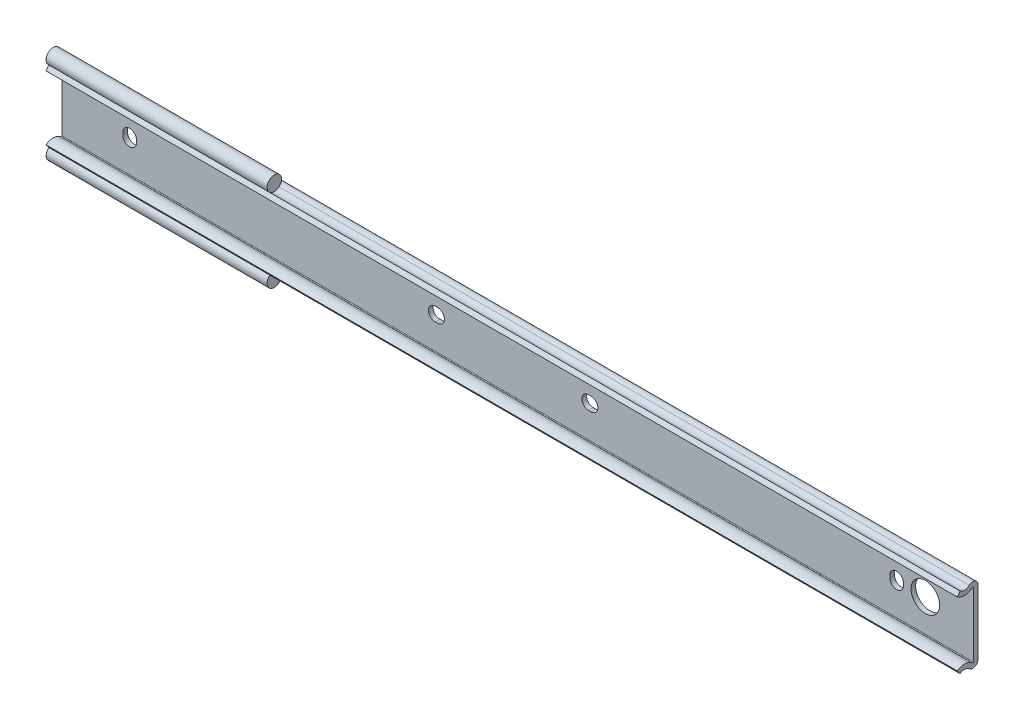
ISO-10303-21;
HEADER;
FILE_DESCRIPTION(('STEP AP214'),'2;1');
FILE_NAME('part.step','',(''),(''),'','','');
FILE_SCHEMA(('AUTOMOTIVE_DESIGN { 1 0 10303 214 1 1 1 1 }'));
ENDSEC;
DATA;
#1=APPLICATION_CONTEXT('core data for automotive mechanical design processes');
#2=APPLICATION_PROTOCOL_DEFINITION('international standard','automotive_design',2000,#1);
#3=PRODUCT_CONTEXT('',#1,'mechanical');
#4=PRODUCT('Part','Part','',(#3));
#5=PRODUCT_RELATED_PRODUCT_CATEGORY('part','',(#4));
#6=PRODUCT_DEFINITION_FORMATION('','',#4);
#7=PRODUCT_DEFINITION_CONTEXT('part definition',#1,'design');
#8=PRODUCT_DEFINITION('design','',#6,#7);
#9=PRODUCT_DEFINITION_SHAPE('','',#8);
#10=(LENGTH_UNIT() NAMED_UNIT(*) SI_UNIT(.MILLI.,.METRE.));
#11=(NAMED_UNIT(*) PLANE_ANGLE_UNIT() SI_UNIT($,.RADIAN.));
#12=(NAMED_UNIT(*) SI_UNIT($,.STERADIAN.) SOLID_ANGLE_UNIT());
#13=UNCERTAINTY_MEASURE_WITH_UNIT(LENGTH_MEASURE(1.E-05),#10,'distance_accuracy_value','');
#14=(GEOMETRIC_REPRESENTATION_CONTEXT(3) GLOBAL_UNCERTAINTY_ASSIGNED_CONTEXT((#13)) GLOBAL_UNIT_ASSIGNED_CONTEXT((#10,
#11,#12)) REPRESENTATION_CONTEXT('',''));
#15=CARTESIAN_POINT('',(0.,0.,0.));
#16=DIRECTION('',(0.,0.,1.));
#17=DIRECTION('',(1.,0.,0.));
#18=AXIS2_PLACEMENT_3D('',#15,#16,#17);
#19=CARTESIAN_POINT('',(279.4,10.6847650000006,1.74000019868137));
#20=DIRECTION('',(-1.,0.,0.));
#21=DIRECTION('',(0.,0.,1.));
#22=AXIS2_PLACEMENT_3D('',#19,#20,#21);
#23=CYLINDRICAL_SURFACE('',#22,1.7400001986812);
#24=CARTESIAN_POINT('',(-22.4,10.6847650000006,1.74000019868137));
#25=DIRECTION('',(1.,0.,0.));
#26=DIRECTION('',(0.,0.,-1.));
#27=AXIS2_PLACEMENT_3D('',#24,#25,#26);
#28=CIRCLE('',#27,1.7400001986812);
#29=CARTESIAN_POINT('',(-22.4,12.421670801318,1.84372545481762));
#30=VERTEX_POINT('',#29);
#31=CARTESIAN_POINT('',(-22.4,12.1726708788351,2.64207380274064));
#32=VERTEX_POINT('',#31);
#33=EDGE_CURVE('E251',#30,#32,#28,.T.);
#34=ORIENTED_EDGE('',*,*,#33,.T.);
#35=DIRECTION('',(-1.,0.,0.));
#36=VECTOR('',#35,1.);
#37=CARTESIAN_POINT('',(14.2,12.1726708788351,2.64207380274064));
#38=LINE('',#37,#36);
#39=CARTESIAN_POINT('',(50.8,12.1726708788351,2.64207380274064));
#40=VERTEX_POINT('',#39);
#41=EDGE_CURVE('E468',#32,#40,#38,.F.);
#42=ORIENTED_EDGE('',*,*,#41,.T.);
#43=CARTESIAN_POINT('',(50.8,10.6847650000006,1.74000019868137));
#44=DIRECTION('',(-1.,0.,0.));
#45=DIRECTION('',(0.,0.,1.));
#46=AXIS2_PLACEMENT_3D('',#43,#44,#45);
#47=CIRCLE('',#46,1.7400001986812);
#48=CARTESIAN_POINT('',(50.8,11.9768810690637,2.90534853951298));
#49=VERTEX_POINT('',#48);
#50=EDGE_CURVE('E464',#49,#40,#47,.T.);
#51=ORIENTED_EDGE('',*,*,#50,.F.);
#52=DIRECTION('',(-1.,0.,0.));
#53=VECTOR('',#52,1.);
#54=CARTESIAN_POINT('',(279.4,11.9768810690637,2.90534853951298));
#55=LINE('',#54,#53);
#56=CARTESIAN_POINT('',(279.4,11.9768810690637,2.90534853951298));
#57=VERTEX_POINT('',#56);
#58=EDGE_CURVE('E341',#57,#49,#55,.T.);
#59=ORIENTED_EDGE('',*,*,#58,.F.);
#60=CARTESIAN_POINT('',(279.4,10.6847650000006,1.74000019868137));
#61=DIRECTION('',(1.,0.,0.));
#62=DIRECTION('',(0.,0.,-1.));
#63=AXIS2_PLACEMENT_3D('',#60,#61,#62);
#64=CIRCLE('',#63,1.7400001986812);
#65=CARTESIAN_POINT('',(279.4,12.421670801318,1.84372545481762));
#66=VERTEX_POINT('',#65);
#67=EDGE_CURVE('E248',#66,#57,#64,.T.);
#68=ORIENTED_EDGE('',*,*,#67,.F.);
#69=CARTESIAN_POINT('',(279.4,10.6847650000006,1.74000019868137));
#70=DIRECTION('',(-1.,0.,0.));
#71=DIRECTION('',(0.,0.998221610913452,0.0596122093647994));
#72=AXIS2_PLACEMENT_3D('',#69,#70,#71);
#73=CIRCLE('',#72,1.7400001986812);
#74=CARTESIAN_POINT('',(279.4,12.421670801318,1.63627494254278));
#75=VERTEX_POINT('',#74);
#76=EDGE_CURVE('E239',#66,#75,#73,.T.);
#77=ORIENTED_EDGE('',*,*,#76,.T.);
#78=CARTESIAN_POINT('',(279.4,10.6847650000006,0.));
#79=VERTEX_POINT('',#78);
#80=EDGE_CURVE('E236',#79,#75,#64,.T.);
#81=ORIENTED_EDGE('',*,*,#80,.F.);
#82=DIRECTION('',(-1.,0.,0.));
#83=VECTOR('',#82,1.);
#84=CARTESIAN_POINT('',(279.4,10.6847650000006,0.));
#85=LINE('',#84,#83);
#86=CARTESIAN_POINT('',(-22.4,10.6847650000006,0.));
#87=VERTEX_POINT('',#86);
#88=EDGE_CURVE('E373',#79,#87,#85,.T.);
#89=ORIENTED_EDGE('',*,*,#88,.T.);
#90=CARTESIAN_POINT('',(-22.4,12.421670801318,1.63627494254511));
#91=VERTEX_POINT('',#90);
#92=EDGE_CURVE('E268',#87,#91,#28,.T.);
#93=ORIENTED_EDGE('',*,*,#92,.T.);
#94=CARTESIAN_POINT('',(-22.4,10.6847650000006,1.74000019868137));
#95=DIRECTION('',(1.,0.,0.));
#96=DIRECTION('',(0.,0.998221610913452,-0.059612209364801));
#97=AXIS2_PLACEMENT_3D('',#94,#95,#96);
#98=CIRCLE('',#97,1.7400001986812);
#99=EDGE_CURVE('E265',#91,#30,#98,.T.);
#100=ORIENTED_EDGE('',*,*,#99,.T.);
#101=EDGE_LOOP('',(#34,#42,#51,#59,#68,#77,#81,#89,#93,#100));
#102=FACE_BOUND('',#101,.T.);
#103=ADVANCED_FACE('F14',(#102),#23,.T.);
#104=CARTESIAN_POINT('',(279.4,10.6847650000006,1.74000019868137));
#105=DIRECTION('',(1.,0.,0.));
#106=DIRECTION('',(0.,0.,-1.));
#107=AXIS2_PLACEMENT_3D('',#104,#105,#106);
#108=PLANE('',#107);
#109=DIRECTION('',(0.,1.,0.));
#110=VECTOR('',#109,1.);
#111=CARTESIAN_POINT('',(279.4,-10.6847650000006,0.));
#112=LINE('',#111,#110);
#113=CARTESIAN_POINT('',(279.4,-10.6847650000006,0.));
#114=VERTEX_POINT('',#113);
#115=EDGE_CURVE('E243',#114,#79,#112,.T.);
#116=ORIENTED_EDGE('',*,*,#115,.T.);
#117=ORIENTED_EDGE('',*,*,#80,.T.);
#118=ORIENTED_EDGE('',*,*,#76,.F.);
#119=ORIENTED_EDGE('',*,*,#67,.T.);
#120=CARTESIAN_POINT('',(279.4,13.7450000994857,4.50000028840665));
#121=DIRECTION('',(-1.,0.,0.));
#122=DIRECTION('',(0.,0.,-1.));
#123=AXIS2_PLACEMENT_3D('',#120,#121,#122);
#124=CIRCLE('',#123,2.38099960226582);
#125=CARTESIAN_POINT('',(279.4,11.8434490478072,5.93292132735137));
#126=VERTEX_POINT('',#125);
#127=EDGE_CURVE('E247',#57,#126,#124,.T.);
#128=ORIENTED_EDGE('',*,*,#127,.T.);
#129=DIRECTION('',(0.,-0.798635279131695,0.601815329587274));
#130=VECTOR('',#129,1.);
#131=CARTESIAN_POINT('',(279.4,10.6055642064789,6.86573520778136));
#132=LINE('',#131,#130);
#133=CARTESIAN_POINT('',(279.4,10.6055642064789,6.86573520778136));
#134=VERTEX_POINT('',#133);
#135=EDGE_CURVE('E391',#126,#134,#132,.T.);
#136=ORIENTED_EDGE('',*,*,#135,.T.);
#137=CARTESIAN_POINT('',(279.4,13.7450000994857,4.50000028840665));
#138=DIRECTION('',(1.,0.,0.));
#139=DIRECTION('',(0.,0.,-1.));
#140=AXIS2_PLACEMENT_3D('',#137,#138,#139);
#141=CIRCLE('',#140,3.9309998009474);
#142=CARTESIAN_POINT('',(279.4,10.8258581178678,1.86725086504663));
#143=VERTEX_POINT('',#142);
#144=EDGE_CURVE('E390',#134,#143,#141,.T.);
#145=ORIENTED_EDGE('',*,*,#144,.T.);
#146=CARTESIAN_POINT('',(279.4,10.6847650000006,1.74000019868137));
#147=DIRECTION('',(-1.,0.,0.));
#148=DIRECTION('',(0.,0.,-1.));
#149=AXIS2_PLACEMENT_3D('',#146,#147,#148);
#150=CIRCLE('',#149,0.18999999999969);
#151=CARTESIAN_POINT('',(279.4,10.6847650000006,1.55000019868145));
#152=VERTEX_POINT('',#151);
#153=EDGE_CURVE('E388',#143,#152,#150,.T.);
#154=ORIENTED_EDGE('',*,*,#153,.T.);
#155=DIRECTION('',(0.,-1.,0.));
#156=VECTOR('',#155,1.);
#157=CARTESIAN_POINT('',(279.4,-10.6847650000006,1.55000019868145));
#158=LINE('',#157,#156);
#159=CARTESIAN_POINT('',(279.4,-10.6847650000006,1.55000019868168));
#160=VERTEX_POINT('',#159);
#161=EDGE_CURVE('E386',#152,#160,#158,.T.);
#162=ORIENTED_EDGE('',*,*,#161,.T.);
#163=CARTESIAN_POINT('',(279.4,-10.6847650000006,1.74000019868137));
#164=DIRECTION('',(-1.,0.,0.));
#165=DIRECTION('',(0.,0.,1.));
#166=AXIS2_PLACEMENT_3D('',#163,#164,#165);
#167=CIRCLE('',#166,0.18999999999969);
#168=CARTESIAN_POINT('',(279.4,-10.8258581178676,1.86725086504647));
#169=VERTEX_POINT('',#168);
#170=EDGE_CURVE('E384',#160,#169,#167,.T.);
#171=ORIENTED_EDGE('',*,*,#170,.T.);
#172=CARTESIAN_POINT('',(279.4,-13.7450000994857,4.50000028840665));
#173=DIRECTION('',(1.,0.,0.));
#174=DIRECTION('',(0.,0.,1.));
#175=AXIS2_PLACEMENT_3D('',#172,#173,#174);
#176=CIRCLE('',#175,3.9309998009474);
#177=CARTESIAN_POINT('',(279.4,-10.6055642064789,6.86573520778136));
#178=VERTEX_POINT('',#177);
#179=EDGE_CURVE('E382',#169,#178,#176,.T.);
#180=ORIENTED_EDGE('',*,*,#179,.T.);
#181=DIRECTION('',(0.,-0.798635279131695,-0.601815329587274));
#182=VECTOR('',#181,1.);
#183=CARTESIAN_POINT('',(279.4,-10.6055642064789,6.86573520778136));
#184=LINE('',#183,#182);
#185=CARTESIAN_POINT('',(279.4,-11.8434490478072,5.93292132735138));
#186=VERTEX_POINT('',#185);
#187=EDGE_CURVE('E380',#178,#186,#184,.T.);
#188=ORIENTED_EDGE('',*,*,#187,.T.);
#189=CARTESIAN_POINT('',(279.4,-13.7450000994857,4.50000028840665));
#190=DIRECTION('',(-1.,0.,0.));
#191=DIRECTION('',(0.,0.,1.));
#192=AXIS2_PLACEMENT_3D('',#189,#190,#191);
#193=CIRCLE('',#192,2.38099960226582);
#194=CARTESIAN_POINT('',(279.4,-11.9768810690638,2.90534853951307));
#195=VERTEX_POINT('',#194);
#196=EDGE_CURVE('E378',#186,#195,#193,.T.);
#197=ORIENTED_EDGE('',*,*,#196,.T.);
#198=CARTESIAN_POINT('',(279.4,-10.6847650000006,1.74000019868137));
#199=DIRECTION('',(1.,0.,0.));
#200=DIRECTION('',(0.,0.,1.));
#201=AXIS2_PLACEMENT_3D('',#198,#199,#200);
#202=CIRCLE('',#201,1.7400001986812);
#203=EDGE_CURVE('E376',#195,#114,#202,.T.);
#204=ORIENTED_EDGE('',*,*,#203,.T.);
#205=EDGE_LOOP('',(#116,#117,#118,#119,#128,#136,#145,#154,#162,#171,#180,#188,#197,#204));
#206=FACE_BOUND('',#205,.T.);
#207=ADVANCED_FACE('F238',(#206),#108,.T.);
#208=CARTESIAN_POINT('',(-22.4,10.6847650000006,1.74000019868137));
#209=DIRECTION('',(1.,0.,0.));
#210=DIRECTION('',(0.,0.,-1.));
#211=AXIS2_PLACEMENT_3D('',#208,#209,#210);
#212=PLANE('',#211);
#213=CARTESIAN_POINT('',(-22.4,13.745,4.45));
#214=DIRECTION('',(-1.,0.,0.));
#215=DIRECTION('',(0.,0.,1.));
#216=AXIS2_PLACEMENT_3D('',#213,#214,#215);
#217=CIRCLE('',#216,2.396);
#218=CARTESIAN_POINT('',(-22.3999999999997,11.4666473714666,5.19156948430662));
#219=VERTEX_POINT('',#218);
#220=EDGE_CURVE('E460',#219,#32,#217,.T.);
#221=ORIENTED_EDGE('',*,*,#220,.T.);
#222=ORIENTED_EDGE('',*,*,#33,.F.);
#223=ORIENTED_EDGE('',*,*,#99,.F.);
#224=ORIENTED_EDGE('',*,*,#92,.F.);
#225=DIRECTION('',(0.,1.,0.));
#226=VECTOR('',#225,1.);
#227=CARTESIAN_POINT('',(-22.4,-10.6847650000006,0.));
#228=LINE('',#227,#226);
#229=CARTESIAN_POINT('',(-22.4,-10.6847650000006,0.));
#230=VERTEX_POINT('',#229);
#231=EDGE_CURVE('E294',#230,#87,#228,.T.);
#232=ORIENTED_EDGE('',*,*,#231,.F.);
#233=CARTESIAN_POINT('',(-22.4,-10.6847650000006,1.74000019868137));
#234=DIRECTION('',(1.,0.,0.));
#235=DIRECTION('',(0.,0.,1.));
#236=AXIS2_PLACEMENT_3D('',#233,#234,#235);
#237=CIRCLE('',#236,1.7400001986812);
#238=CARTESIAN_POINT('',(-22.4,-12.1726708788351,2.64207380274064));
#239=VERTEX_POINT('',#238);
#240=EDGE_CURVE('E292',#239,#230,#237,.T.);
#241=ORIENTED_EDGE('',*,*,#240,.F.);
#242=CARTESIAN_POINT('',(-22.4,-13.745,4.45));
#243=DIRECTION('',(-1.,0.,0.));
#244=DIRECTION('',(0.,0.,-1.));
#245=AXIS2_PLACEMENT_3D('',#242,#243,#244);
#246=CIRCLE('',#245,2.396);
#247=CARTESIAN_POINT('',(-22.4,-11.4666473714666,5.19156948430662));
#248=VERTEX_POINT('',#247);
#249=EDGE_CURVE('E442',#239,#248,#246,.T.);
#250=ORIENTED_EDGE('',*,*,#249,.T.);
#251=CARTESIAN_POINT('',(-22.4,-13.7450000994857,4.50000028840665));
#252=DIRECTION('',(-1.,0.,0.));
#253=DIRECTION('',(0.,0.,1.));
#254=AXIS2_PLACEMENT_3D('',#251,#252,#253);
#255=CIRCLE('',#254,2.38099960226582);
#256=CARTESIAN_POINT('',(-22.4,-11.8434490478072,5.93292132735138));
#257=VERTEX_POINT('',#256);
#258=EDGE_CURVE('E37',#257,#248,#255,.T.);
#259=ORIENTED_EDGE('',*,*,#258,.F.);
#260=DIRECTION('',(0.,-0.798635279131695,-0.601815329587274));
#261=VECTOR('',#260,1.);
#262=CARTESIAN_POINT('',(-22.4,-10.6055642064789,6.86573520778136));
#263=LINE('',#262,#261);
#264=CARTESIAN_POINT('',(-22.4,-10.6055642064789,6.86573520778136));
#265=VERTEX_POINT('',#264);
#266=EDGE_CURVE('E289',#265,#257,#263,.T.);
#267=ORIENTED_EDGE('',*,*,#266,.F.);
#268=CARTESIAN_POINT('',(-22.4,-13.7450000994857,4.50000028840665));
#269=DIRECTION('',(1.,0.,0.));
#270=DIRECTION('',(0.,0.,1.));
#271=AXIS2_PLACEMENT_3D('',#268,#269,#270);
#272=CIRCLE('',#271,3.9309998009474);
#273=CARTESIAN_POINT('',(-22.4,-10.8258581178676,1.86725086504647));
#274=VERTEX_POINT('',#273);
#275=EDGE_CURVE('E287',#274,#265,#272,.T.);
#276=ORIENTED_EDGE('',*,*,#275,.F.);
#277=CARTESIAN_POINT('',(-22.4,-10.6847650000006,1.74000019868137));
#278=DIRECTION('',(-1.,0.,0.));
#279=DIRECTION('',(0.,0.,1.));
#280=AXIS2_PLACEMENT_3D('',#277,#278,#279);
#281=CIRCLE('',#280,0.18999999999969);
#282=CARTESIAN_POINT('',(-22.4,-10.6847650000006,1.55000019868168));
#283=VERTEX_POINT('',#282);
#284=EDGE_CURVE('E285',#283,#274,#281,.T.);
#285=ORIENTED_EDGE('',*,*,#284,.F.);
#286=DIRECTION('',(0.,-1.,0.));
#287=VECTOR('',#286,1.);
#288=CARTESIAN_POINT('',(-22.4,-10.6847650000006,1.55000019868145));
#289=LINE('',#288,#287);
#290=CARTESIAN_POINT('',(-22.4,10.6847650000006,1.55000019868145));
#291=VERTEX_POINT('',#290);
#292=EDGE_CURVE('E283',#291,#283,#289,.T.);
#293=ORIENTED_EDGE('',*,*,#292,.F.);
#294=CARTESIAN_POINT('',(-22.4,10.6847650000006,1.74000019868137));
#295=DIRECTION('',(-1.,0.,0.));
#296=DIRECTION('',(0.,0.,-1.));
#297=AXIS2_PLACEMENT_3D('',#294,#295,#296);
#298=CIRCLE('',#297,0.18999999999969);
#299=CARTESIAN_POINT('',(-22.4,10.8258581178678,1.86725086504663));
#300=VERTEX_POINT('',#299);
#301=EDGE_CURVE('E281',#300,#291,#298,.T.);
#302=ORIENTED_EDGE('',*,*,#301,.F.);
#303=CARTESIAN_POINT('',(-22.4,13.7450000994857,4.50000028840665));
#304=DIRECTION('',(1.,0.,0.));
#305=DIRECTION('',(0.,0.,-1.));
#306=AXIS2_PLACEMENT_3D('',#303,#304,#305);
#307=CIRCLE('',#306,3.9309998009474);
#308=CARTESIAN_POINT('',(-22.4,10.6055642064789,6.86573520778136));
#309=VERTEX_POINT('',#308);
#310=EDGE_CURVE('E279',#309,#300,#307,.T.);
#311=ORIENTED_EDGE('',*,*,#310,.F.);
#312=DIRECTION('',(0.,-0.798635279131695,0.601815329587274));
#313=VECTOR('',#312,1.);
#314=CARTESIAN_POINT('',(-22.4,10.6055642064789,6.86573520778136));
#315=LINE('',#314,#313);
#316=CARTESIAN_POINT('',(-22.4,11.8434490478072,5.93292132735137));
#317=VERTEX_POINT('',#316);
#318=EDGE_CURVE('E277',#317,#309,#315,.T.);
#319=ORIENTED_EDGE('',*,*,#318,.F.);
#320=CARTESIAN_POINT('',(-22.4,13.7450000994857,4.50000028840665));
#321=DIRECTION('',(-1.,0.,0.));
#322=DIRECTION('',(0.,0.,-1.));
#323=AXIS2_PLACEMENT_3D('',#320,#321,#322);
#324=CIRCLE('',#323,2.38099960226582);
#325=EDGE_CURVE('E274',#219,#317,#324,.T.);
#326=ORIENTED_EDGE('',*,*,#325,.F.);
#327=EDGE_LOOP('',(#221,#222,#223,#224,#232,#241,#250,#259,#267,#276,#285,#293,#302,#311,#319,#326));
#328=FACE_BOUND('',#327,.T.);
#329=ADVANCED_FACE('F308',(#328),#212,.F.);
#330=CARTESIAN_POINT('',(279.4,13.7450000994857,4.50000028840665));
#331=DIRECTION('',(-1.,0.,0.));
#332=DIRECTION('',(0.,0.,1.));
#333=AXIS2_PLACEMENT_3D('',#330,#331,#332);
#334=CYLINDRICAL_SURFACE('',#333,2.38099960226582);
#335=CARTESIAN_POINT('',(50.8,13.7450000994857,4.50000028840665));
#336=DIRECTION('',(-1.,0.,0.));
#337=DIRECTION('',(0.,0.,1.));
#338=AXIS2_PLACEMENT_3D('',#335,#336,#337);
#339=CIRCLE('',#338,2.38099960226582);
#340=CARTESIAN_POINT('',(50.8,11.4666473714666,5.19156948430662));
#341=VERTEX_POINT('',#340);
#342=EDGE_CURVE('E338',#341,#49,#339,.F.);
#343=ORIENTED_EDGE('',*,*,#342,.F.);
#344=DIRECTION('',(-1.,0.,0.));
#345=VECTOR('',#344,1.);
#346=CARTESIAN_POINT('',(14.2,11.4666473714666,5.19156948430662));
#347=LINE('',#346,#345);
#348=EDGE_CURVE('E335',#341,#219,#347,.T.);
#349=ORIENTED_EDGE('',*,*,#348,.T.);
#350=ORIENTED_EDGE('',*,*,#325,.T.);
#351=DIRECTION('',(-1.,0.,0.));
#352=VECTOR('',#351,1.);
#353=CARTESIAN_POINT('',(279.4,11.8434490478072,5.93292132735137));
#354=LINE('',#353,#352);
#355=EDGE_CURVE('E344',#126,#317,#354,.T.);
#356=ORIENTED_EDGE('',*,*,#355,.F.);
#357=ORIENTED_EDGE('',*,*,#127,.F.);
#358=ORIENTED_EDGE('',*,*,#58,.T.);
#359=EDGE_LOOP('',(#343,#349,#350,#356,#357,#358));
#360=FACE_BOUND('',#359,.T.);
#361=ADVANCED_FACE('F318',(#360),#334,.F.);
#362=CARTESIAN_POINT('',(279.4,10.6055642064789,6.86573520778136));
#363=DIRECTION('',(0.,-0.601815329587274,-0.798635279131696));
#364=DIRECTION('',(0.,0.798635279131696,-0.601815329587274));
#365=AXIS2_PLACEMENT_3D('',#362,#363,#364);
#366=PLANE('',#365);
#367=ORIENTED_EDGE('',*,*,#318,.T.);
#368=DIRECTION('',(-1.,0.,0.));
#369=VECTOR('',#368,1.);
#370=CARTESIAN_POINT('',(279.4,10.6055642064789,6.86573520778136));
#371=LINE('',#370,#369);
#372=EDGE_CURVE('E347',#134,#309,#371,.T.);
#373=ORIENTED_EDGE('',*,*,#372,.F.);
#374=ORIENTED_EDGE('',*,*,#135,.F.);
#375=ORIENTED_EDGE('',*,*,#355,.T.);
#376=EDGE_LOOP('',(#367,#373,#374,#375));
#377=FACE_BOUND('',#376,.T.);
#378=ADVANCED_FACE('F399',(#377),#366,.F.);
#379=CARTESIAN_POINT('',(279.4,13.7450000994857,4.50000028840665));
#380=DIRECTION('',(-1.,0.,0.));
#381=DIRECTION('',(0.,0.,1.));
#382=AXIS2_PLACEMENT_3D('',#379,#380,#381);
#383=CYLINDRICAL_SURFACE('',#382,3.9309998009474);
#384=ORIENTED_EDGE('',*,*,#310,.T.);
#385=DIRECTION('',(-1.,0.,0.));
#386=VECTOR('',#385,1.);
#387=CARTESIAN_POINT('',(279.4,10.8258581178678,1.86725086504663));
#388=LINE('',#387,#386);
#389=EDGE_CURVE('E350',#143,#300,#388,.T.);
#390=ORIENTED_EDGE('',*,*,#389,.F.);
#391=ORIENTED_EDGE('',*,*,#144,.F.);
#392=ORIENTED_EDGE('',*,*,#372,.T.);
#393=EDGE_LOOP('',(#384,#390,#391,#392));
#394=FACE_BOUND('',#393,.T.);
#395=ADVANCED_FACE('F404',(#394),#383,.T.);
#396=CARTESIAN_POINT('',(279.4,10.6847650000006,1.74000019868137));
#397=DIRECTION('',(-1.,0.,0.));
#398=DIRECTION('',(0.,0.,1.));
#399=AXIS2_PLACEMENT_3D('',#396,#397,#398);
#400=CYLINDRICAL_SURFACE('',#399,0.18999999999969);
#401=ORIENTED_EDGE('',*,*,#301,.T.);
#402=DIRECTION('',(-1.,0.,0.));
#403=VECTOR('',#402,1.);
#404=CARTESIAN_POINT('',(279.4,10.6847650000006,1.55000019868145));
#405=LINE('',#404,#403);
#406=EDGE_CURVE('E353',#152,#291,#405,.T.);
#407=ORIENTED_EDGE('',*,*,#406,.F.);
#408=ORIENTED_EDGE('',*,*,#153,.F.);
#409=ORIENTED_EDGE('',*,*,#389,.T.);
#410=EDGE_LOOP('',(#401,#407,#408,#409));
#411=FACE_BOUND('',#410,.T.);
#412=ADVANCED_FACE('F410',(#411),#400,.F.);
#413=CARTESIAN_POINT('',(279.4,-10.6847650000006,1.55000019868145));
#414=DIRECTION('',(0.,0.,-1.));
#415=DIRECTION('',(-1.,0.,0.));
#416=AXIS2_PLACEMENT_3D('',#413,#414,#415);
#417=PLANE('',#416);
#418=CARTESIAN_POINT('',(263.5,0.,1.55000019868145));
#419=DIRECTION('',(0.,0.,-1.));
#420=DIRECTION('',(-1.,0.,0.));
#421=AXIS2_PLACEMENT_3D('',#418,#419,#420);
#422=CIRCLE('',#421,4.75);
#423=CARTESIAN_POINT('',(258.75,0.,1.55000019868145));
#424=VERTEX_POINT('',#423);
#425=EDGE_CURVE('E450',#424,#424,#422,.F.);
#426=ORIENTED_EDGE('',*,*,#425,.F.);
#427=EDGE_LOOP('',(#426));
#428=FACE_BOUND('',#427,.T.);
#429=DIRECTION('',(0.,-1.,0.));
#430=VECTOR('',#429,1.);
#431=CARTESIAN_POINT('',(-2.25,-0.4,1.55000019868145));
#432=LINE('',#431,#430);
#433=CARTESIAN_POINT('',(-2.25,0.4,1.55000019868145));
#434=VERTEX_POINT('',#433);
#435=CARTESIAN_POINT('',(-2.25,-0.4,1.55000019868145));
#436=VERTEX_POINT('',#435);
#437=EDGE_CURVE('E472',#434,#436,#432,.T.);
#438=ORIENTED_EDGE('',*,*,#437,.F.);
#439=CARTESIAN_POINT('',(0.,0.4,1.55000019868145));
#440=DIRECTION('',(0.,0.,-1.));
#441=DIRECTION('',(-1.,0.,0.));
#442=AXIS2_PLACEMENT_3D('',#439,#440,#441);
#443=CIRCLE('',#442,2.24999999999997);
#444=CARTESIAN_POINT('',(2.25,0.4,1.55000019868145));
#445=VERTEX_POINT('',#444);
#446=EDGE_CURVE('E475',#445,#434,#443,.F.);
#447=ORIENTED_EDGE('',*,*,#446,.F.);
#448=DIRECTION('',(0.,1.,0.));
#449=VECTOR('',#448,1.);
#450=CARTESIAN_POINT('',(2.25,0.4,1.55000019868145));
#451=LINE('',#450,#449);
#452=CARTESIAN_POINT('',(2.25,-0.4,1.55000019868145));
#453=VERTEX_POINT('',#452);
#454=EDGE_CURVE('E492',#453,#445,#451,.T.);
#455=ORIENTED_EDGE('',*,*,#454,.F.);
#456=CARTESIAN_POINT('',(0.,-0.4,1.55000019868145));
#457=DIRECTION('',(0.,0.,-1.));
#458=DIRECTION('',(-1.,0.,0.));
#459=AXIS2_PLACEMENT_3D('',#456,#457,#458);
#460=CIRCLE('',#459,2.24999999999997);
#461=EDGE_CURVE('E470',#436,#453,#460,.F.);
#462=ORIENTED_EDGE('',*,*,#461,.F.);
#463=EDGE_LOOP('',(#438,#447,#455,#462));
#464=FACE_BOUND('',#463,.T.);
#465=DIRECTION('',(-1.,0.,0.));
#466=VECTOR('',#465,1.);
#467=CARTESIAN_POINT('',(152.8,2.25,1.55000019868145));
#468=LINE('',#467,#466);
#469=CARTESIAN_POINT('',(152.8,2.25,1.55000019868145));
#470=VERTEX_POINT('',#469);
#471=CARTESIAN_POINT('',(152.,2.25,1.55000019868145));
#472=VERTEX_POINT('',#471);
#473=EDGE_CURVE('E503',#470,#472,#468,.T.);
#474=ORIENTED_EDGE('',*,*,#473,.F.);
#475=CARTESIAN_POINT('',(152.8,0.,1.55000019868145));
#476=DIRECTION('',(0.,0.,-1.));
#477=DIRECTION('',(-1.,0.,0.));
#478=AXIS2_PLACEMENT_3D('',#475,#476,#477);
#479=CIRCLE('',#478,2.25);
#480=CARTESIAN_POINT('',(152.8,-2.25,1.55000019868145));
#481=VERTEX_POINT('',#480);
#482=EDGE_CURVE('E506',#481,#470,#479,.F.);
#483=ORIENTED_EDGE('',*,*,#482,.F.);
#484=DIRECTION('',(1.,0.,0.));
#485=VECTOR('',#484,1.);
#486=CARTESIAN_POINT('',(152.8,-2.25,1.55000019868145));
#487=LINE('',#486,#485);
#488=CARTESIAN_POINT('',(152.,-2.25,1.55000019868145));
#489=VERTEX_POINT('',#488);
#490=EDGE_CURVE('E523',#489,#481,#487,.T.);
#491=ORIENTED_EDGE('',*,*,#490,.F.);
#492=CARTESIAN_POINT('',(152.,0.,1.55000019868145));
#493=DIRECTION('',(0.,0.,-1.));
#494=DIRECTION('',(-1.,0.,0.));
#495=AXIS2_PLACEMENT_3D('',#492,#493,#494);
#496=CIRCLE('',#495,2.25);
#497=EDGE_CURVE('E501',#472,#489,#496,.F.);
#498=ORIENTED_EDGE('',*,*,#497,.F.);
#499=EDGE_LOOP('',(#474,#483,#491,#498));
#500=FACE_BOUND('',#499,.T.);
#501=DIRECTION('',(-1.,0.,0.));
#502=VECTOR('',#501,1.);
#503=CARTESIAN_POINT('',(102.,2.25,1.55000019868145));
#504=LINE('',#503,#502);
#505=CARTESIAN_POINT('',(102.,2.25,1.55000019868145));
#506=VERTEX_POINT('',#505);
#507=CARTESIAN_POINT('',(101.2,2.25,1.55000019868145));
#508=VERTEX_POINT('',#507);
#509=EDGE_CURVE('E534',#506,#508,#504,.T.);
#510=ORIENTED_EDGE('',*,*,#509,.F.);
#511=CARTESIAN_POINT('',(102.,0.,1.55000019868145));
#512=DIRECTION('',(0.,0.,-1.));
#513=DIRECTION('',(-1.,0.,0.));
#514=AXIS2_PLACEMENT_3D('',#511,#512,#513);
#515=CIRCLE('',#514,2.25);
#516=CARTESIAN_POINT('',(102.,-2.25,1.55000019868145));
#517=VERTEX_POINT('',#516);
#518=EDGE_CURVE('E537',#517,#506,#515,.F.);
#519=ORIENTED_EDGE('',*,*,#518,.F.);
#520=DIRECTION('',(1.,0.,0.));
#521=VECTOR('',#520,1.);
#522=CARTESIAN_POINT('',(102.,-2.25,1.55000019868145));
#523=LINE('',#522,#521);
#524=CARTESIAN_POINT('',(101.2,-2.25,1.55000019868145));
#525=VERTEX_POINT('',#524);
#526=EDGE_CURVE('E554',#525,#517,#523,.T.);
#527=ORIENTED_EDGE('',*,*,#526,.F.);
#528=CARTESIAN_POINT('',(101.2,0.,1.55000019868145));
#529=DIRECTION('',(0.,0.,-1.));
#530=DIRECTION('',(-1.,0.,0.));
#531=AXIS2_PLACEMENT_3D('',#528,#529,#530);
#532=CIRCLE('',#531,2.25);
#533=EDGE_CURVE('E532',#508,#525,#532,.F.);
#534=ORIENTED_EDGE('',*,*,#533,.F.);
#535=EDGE_LOOP('',(#510,#519,#527,#534));
#536=FACE_BOUND('',#535,.T.);
#537=DIRECTION('',(0.,-1.,0.));
#538=VECTOR('',#537,1.);
#539=CARTESIAN_POINT('',(251.75,-0.399999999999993,1.55000019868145));
#540=LINE('',#539,#538);
#541=CARTESIAN_POINT('',(251.75,0.400000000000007,1.55000019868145));
#542=VERTEX_POINT('',#541);
#543=CARTESIAN_POINT('',(251.75,-0.399999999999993,1.55000019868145));
#544=VERTEX_POINT('',#543);
#545=EDGE_CURVE('E565',#542,#544,#540,.T.);
#546=ORIENTED_EDGE('',*,*,#545,.F.);
#547=CARTESIAN_POINT('',(254.,0.400000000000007,1.55000019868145));
#548=DIRECTION('',(0.,0.,-1.));
#549=DIRECTION('',(-1.,0.,0.));
#550=AXIS2_PLACEMENT_3D('',#547,#548,#549);
#551=CIRCLE('',#550,2.24999999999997);
#552=CARTESIAN_POINT('',(256.25,0.400000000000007,1.55000019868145));
#553=VERTEX_POINT('',#552);
#554=EDGE_CURVE('E568',#553,#542,#551,.F.);
#555=ORIENTED_EDGE('',*,*,#554,.F.);
#556=DIRECTION('',(0.,1.,0.));
#557=VECTOR('',#556,1.);
#558=CARTESIAN_POINT('',(256.25,0.400000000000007,1.55000019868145));
#559=LINE('',#558,#557);
#560=CARTESIAN_POINT('',(256.25,-0.399999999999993,1.55000019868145));
#561=VERTEX_POINT('',#560);
#562=EDGE_CURVE('E252',#561,#553,#559,.T.);
#563=ORIENTED_EDGE('',*,*,#562,.F.);
#564=CARTESIAN_POINT('',(254.,-0.399999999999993,1.55000019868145));
#565=DIRECTION('',(0.,0.,-1.));
#566=DIRECTION('',(-1.,0.,0.));
#567=AXIS2_PLACEMENT_3D('',#564,#565,#566);
#568=CIRCLE('',#567,2.24999999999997);
#569=EDGE_CURVE('E563',#544,#561,#568,.F.);
#570=ORIENTED_EDGE('',*,*,#569,.F.);
#571=EDGE_LOOP('',(#546,#555,#563,#570));
#572=FACE_BOUND('',#571,.T.);
#573=ORIENTED_EDGE('',*,*,#292,.T.);
#574=DIRECTION('',(-1.,0.,0.));
#575=VECTOR('',#574,1.);
#576=CARTESIAN_POINT('',(279.4,-10.6847650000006,1.55000019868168));
#577=LINE('',#576,#575);
#578=EDGE_CURVE('E356',#160,#283,#577,.T.);
#579=ORIENTED_EDGE('',*,*,#578,.F.);
#580=ORIENTED_EDGE('',*,*,#161,.F.);
#581=ORIENTED_EDGE('',*,*,#406,.T.);
#582=EDGE_LOOP('',(#573,#579,#580,#581));
#583=FACE_BOUND('',#582,.T.);
#584=ADVANCED_FACE('F414',(#428,#464,#500,#536,#572,#583),#417,.F.);
#585=CARTESIAN_POINT('',(279.4,-10.6847650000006,1.74000019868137));
#586=DIRECTION('',(-1.,0.,0.));
#587=DIRECTION('',(0.,0.,1.));
#588=AXIS2_PLACEMENT_3D('',#585,#586,#587);
#589=CYLINDRICAL_SURFACE('',#588,0.18999999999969);
#590=ORIENTED_EDGE('',*,*,#284,.T.);
#591=DIRECTION('',(-1.,0.,0.));
#592=VECTOR('',#591,1.);
#593=CARTESIAN_POINT('',(279.4,-10.8258581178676,1.86725086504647));
#594=LINE('',#593,#592);
#595=EDGE_CURVE('E359',#169,#274,#594,.T.);
#596=ORIENTED_EDGE('',*,*,#595,.F.);
#597=ORIENTED_EDGE('',*,*,#170,.F.);
#598=ORIENTED_EDGE('',*,*,#578,.T.);
#599=EDGE_LOOP('',(#590,#596,#597,#598));
#600=FACE_BOUND('',#599,.T.);
#601=ADVANCED_FACE('F419',(#600),#589,.F.);
#602=CARTESIAN_POINT('',(279.4,-13.7450000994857,4.50000028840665));
#603=DIRECTION('',(-1.,0.,0.));
#604=DIRECTION('',(0.,0.,1.));
#605=AXIS2_PLACEMENT_3D('',#602,#603,#604);
#606=CYLINDRICAL_SURFACE('',#605,3.9309998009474);
#607=ORIENTED_EDGE('',*,*,#275,.T.);
#608=DIRECTION('',(-1.,0.,0.));
#609=VECTOR('',#608,1.);
#610=CARTESIAN_POINT('',(279.4,-10.6055642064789,6.86573520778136));
#611=LINE('',#610,#609);
#612=EDGE_CURVE('E362',#178,#265,#611,.T.);
#613=ORIENTED_EDGE('',*,*,#612,.F.);
#614=ORIENTED_EDGE('',*,*,#179,.F.);
#615=ORIENTED_EDGE('',*,*,#595,.T.);
#616=EDGE_LOOP('',(#607,#613,#614,#615));
#617=FACE_BOUND('',#616,.T.);
#618=ADVANCED_FACE('F425',(#617),#606,.T.);
#619=CARTESIAN_POINT('',(279.4,-10.6055642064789,6.86573520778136));
#620=DIRECTION('',(0.,0.601815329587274,-0.798635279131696));
#621=DIRECTION('',(0.,0.798635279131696,0.601815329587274));
#622=AXIS2_PLACEMENT_3D('',#619,#620,#621);
#623=PLANE('',#622);
#624=ORIENTED_EDGE('',*,*,#266,.T.);
#625=DIRECTION('',(-1.,0.,0.));
#626=VECTOR('',#625,1.);
#627=CARTESIAN_POINT('',(279.4,-11.8434490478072,5.93292132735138));
#628=LINE('',#627,#626);
#629=EDGE_CURVE('E365',#186,#257,#628,.T.);
#630=ORIENTED_EDGE('',*,*,#629,.F.);
#631=ORIENTED_EDGE('',*,*,#187,.F.);
#632=ORIENTED_EDGE('',*,*,#612,.T.);
#633=EDGE_LOOP('',(#624,#630,#631,#632));
#634=FACE_BOUND('',#633,.T.);
#635=ADVANCED_FACE('F429',(#634),#623,.F.);
#636=CARTESIAN_POINT('',(279.4,-13.7450000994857,4.50000028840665));
#637=DIRECTION('',(-1.,0.,0.));
#638=DIRECTION('',(0.,0.,1.));
#639=AXIS2_PLACEMENT_3D('',#636,#637,#638);
#640=CYLINDRICAL_SURFACE('',#639,2.38099960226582);
#641=ORIENTED_EDGE('',*,*,#258,.T.);
#642=DIRECTION('',(-1.,0.,0.));
#643=VECTOR('',#642,1.);
#644=CARTESIAN_POINT('',(14.2,-11.4666473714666,5.19156948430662));
#645=LINE('',#644,#643);
#646=CARTESIAN_POINT('',(50.8,-11.4666473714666,5.19156948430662));
#647=VERTEX_POINT('',#646);
#648=EDGE_CURVE('E32',#248,#647,#645,.F.);
#649=ORIENTED_EDGE('',*,*,#648,.T.);
#650=CARTESIAN_POINT('',(50.8,-13.7450000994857,4.50000028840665));
#651=DIRECTION('',(1.,0.,0.));
#652=DIRECTION('',(0.,0.,-1.));
#653=AXIS2_PLACEMENT_3D('',#650,#651,#652);
#654=CIRCLE('',#653,2.38099960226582);
#655=CARTESIAN_POINT('',(50.8,-11.9768810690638,2.90534853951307));
#656=VERTEX_POINT('',#655);
#657=EDGE_CURVE('E452',#647,#656,#654,.F.);
#658=ORIENTED_EDGE('',*,*,#657,.T.);
#659=DIRECTION('',(-1.,0.,0.));
#660=VECTOR('',#659,1.);
#661=CARTESIAN_POINT('',(279.4,-11.9768810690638,2.90534853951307));
#662=LINE('',#661,#660);
#663=EDGE_CURVE('E367',#195,#656,#662,.T.);
#664=ORIENTED_EDGE('',*,*,#663,.F.);
#665=ORIENTED_EDGE('',*,*,#196,.F.);
#666=ORIENTED_EDGE('',*,*,#629,.T.);
#667=EDGE_LOOP('',(#641,#649,#658,#664,#665,#666));
#668=FACE_BOUND('',#667,.T.);
#669=ADVANCED_FACE('F432',(#668),#640,.F.);
#670=CARTESIAN_POINT('',(279.4,-10.6847650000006,1.74000019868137));
#671=DIRECTION('',(-1.,0.,0.));
#672=DIRECTION('',(0.,0.,1.));
#673=AXIS2_PLACEMENT_3D('',#670,#671,#672);
#674=CYLINDRICAL_SURFACE('',#673,1.7400001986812);
#675=CARTESIAN_POINT('',(50.8,-10.6847650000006,1.74000019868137));
#676=DIRECTION('',(1.,0.,0.));
#677=DIRECTION('',(0.,0.,-1.));
#678=AXIS2_PLACEMENT_3D('',#675,#676,#677);
#679=CIRCLE('',#678,1.7400001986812);
#680=CARTESIAN_POINT('',(50.8,-12.1726708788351,2.64207380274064));
#681=VERTEX_POINT('',#680);
#682=EDGE_CURVE('E24',#656,#681,#679,.T.);
#683=ORIENTED_EDGE('',*,*,#682,.T.);
#684=DIRECTION('',(-1.,0.,0.));
#685=VECTOR('',#684,1.);
#686=CARTESIAN_POINT('',(14.2,-12.1726708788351,2.64207380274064));
#687=LINE('',#686,#685);
#688=EDGE_CURVE('E9',#681,#239,#687,.T.);
#689=ORIENTED_EDGE('',*,*,#688,.T.);
#690=ORIENTED_EDGE('',*,*,#240,.T.);
#691=DIRECTION('',(-1.,0.,0.));
#692=VECTOR('',#691,1.);
#693=CARTESIAN_POINT('',(279.4,-10.6847650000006,0.));
#694=LINE('',#693,#692);
#695=EDGE_CURVE('E370',#114,#230,#694,.T.);
#696=ORIENTED_EDGE('',*,*,#695,.F.);
#697=ORIENTED_EDGE('',*,*,#203,.F.);
#698=ORIENTED_EDGE('',*,*,#663,.T.);
#699=EDGE_LOOP('',(#683,#689,#690,#696,#697,#698));
#700=FACE_BOUND('',#699,.T.);
#701=ADVANCED_FACE('F436',(#700),#674,.T.);
#702=CARTESIAN_POINT('',(279.4,-10.6847650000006,0.));
#703=DIRECTION('',(0.,0.,1.));
#704=DIRECTION('',(1.,0.,0.));
#705=AXIS2_PLACEMENT_3D('',#702,#703,#704);
#706=PLANE('',#705);
#707=CARTESIAN_POINT('',(263.5,0.,0.));
#708=DIRECTION('',(0.,0.,-1.));
#709=DIRECTION('',(-1.,0.,0.));
#710=AXIS2_PLACEMENT_3D('',#707,#708,#709);
#711=CIRCLE('',#710,4.75);
#712=CARTESIAN_POINT('',(258.75,0.,0.));
#713=VERTEX_POINT('',#712);
#714=EDGE_CURVE('E455',#713,#713,#711,.T.);
#715=ORIENTED_EDGE('',*,*,#714,.F.);
#716=EDGE_LOOP('',(#715));
#717=FACE_BOUND('',#716,.T.);
#718=DIRECTION('',(0.,-1.,0.));
#719=VECTOR('',#718,1.);
#720=CARTESIAN_POINT('',(2.25,0.4,0.));
#721=LINE('',#720,#719);
#722=CARTESIAN_POINT('',(2.25,0.4,0.));
#723=VERTEX_POINT('',#722);
#724=CARTESIAN_POINT('',(2.25,-0.4,0.));
#725=VERTEX_POINT('',#724);
#726=EDGE_CURVE('E480',#723,#725,#721,.T.);
#727=ORIENTED_EDGE('',*,*,#726,.F.);
#728=CARTESIAN_POINT('',(0.,0.4,0.));
#729=DIRECTION('',(0.,0.,-1.));
#730=DIRECTION('',(-1.,0.,0.));
#731=AXIS2_PLACEMENT_3D('',#728,#729,#730);
#732=CIRCLE('',#731,2.24999999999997);
#733=CARTESIAN_POINT('',(-2.25,0.4,0.));
#734=VERTEX_POINT('',#733);
#735=EDGE_CURVE('E478',#734,#723,#732,.T.);
#736=ORIENTED_EDGE('',*,*,#735,.F.);
#737=DIRECTION('',(0.,1.,0.));
#738=VECTOR('',#737,1.);
#739=CARTESIAN_POINT('',(-2.25,-0.4,0.));
#740=LINE('',#739,#738);
#741=CARTESIAN_POINT('',(-2.25,-0.4,0.));
#742=VERTEX_POINT('',#741);
#743=EDGE_CURVE('E486',#742,#734,#740,.T.);
#744=ORIENTED_EDGE('',*,*,#743,.F.);
#745=CARTESIAN_POINT('',(0.,-0.4,0.));
#746=DIRECTION('',(0.,0.,-1.));
#747=DIRECTION('',(-1.,0.,0.));
#748=AXIS2_PLACEMENT_3D('',#745,#746,#747);
#749=CIRCLE('',#748,2.24999999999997);
#750=EDGE_CURVE('E483',#725,#742,#749,.T.);
#751=ORIENTED_EDGE('',*,*,#750,.F.);
#752=EDGE_LOOP('',(#727,#736,#744,#751));
#753=FACE_BOUND('',#752,.T.);
#754=DIRECTION('',(-1.,0.,0.));
#755=VECTOR('',#754,1.);
#756=CARTESIAN_POINT('',(152.8,-2.25,0.));
#757=LINE('',#756,#755);
#758=CARTESIAN_POINT('',(152.8,-2.25,0.));
#759=VERTEX_POINT('',#758);
#760=CARTESIAN_POINT('',(152.,-2.25,0.));
#761=VERTEX_POINT('',#760);
#762=EDGE_CURVE('E511',#759,#761,#757,.T.);
#763=ORIENTED_EDGE('',*,*,#762,.F.);
#764=CARTESIAN_POINT('',(152.8,0.,0.));
#765=DIRECTION('',(0.,0.,-1.));
#766=DIRECTION('',(-1.,0.,0.));
#767=AXIS2_PLACEMENT_3D('',#764,#765,#766);
#768=CIRCLE('',#767,2.25);
#769=CARTESIAN_POINT('',(152.8,2.25,0.));
#770=VERTEX_POINT('',#769);
#771=EDGE_CURVE('E509',#770,#759,#768,.T.);
#772=ORIENTED_EDGE('',*,*,#771,.F.);
#773=DIRECTION('',(1.,0.,0.));
#774=VECTOR('',#773,1.);
#775=CARTESIAN_POINT('',(152.8,2.25,0.));
#776=LINE('',#775,#774);
#777=CARTESIAN_POINT('',(152.,2.25,0.));
#778=VERTEX_POINT('',#777);
#779=EDGE_CURVE('E517',#778,#770,#776,.T.);
#780=ORIENTED_EDGE('',*,*,#779,.F.);
#781=CARTESIAN_POINT('',(152.,0.,0.));
#782=DIRECTION('',(0.,0.,-1.));
#783=DIRECTION('',(-1.,0.,0.));
#784=AXIS2_PLACEMENT_3D('',#781,#782,#783);
#785=CIRCLE('',#784,2.25);
#786=EDGE_CURVE('E514',#761,#778,#785,.T.);
#787=ORIENTED_EDGE('',*,*,#786,.F.);
#788=EDGE_LOOP('',(#763,#772,#780,#787));
#789=FACE_BOUND('',#788,.T.);
#790=DIRECTION('',(-1.,0.,0.));
#791=VECTOR('',#790,1.);
#792=CARTESIAN_POINT('',(102.,-2.25,0.));
#793=LINE('',#792,#791);
#794=CARTESIAN_POINT('',(102.,-2.25,0.));
#795=VERTEX_POINT('',#794);
#796=CARTESIAN_POINT('',(101.2,-2.25,0.));
#797=VERTEX_POINT('',#796);
#798=EDGE_CURVE('E542',#795,#797,#793,.T.);
#799=ORIENTED_EDGE('',*,*,#798,.F.);
#800=CARTESIAN_POINT('',(102.,0.,0.));
#801=DIRECTION('',(0.,0.,-1.));
#802=DIRECTION('',(-1.,0.,0.));
#803=AXIS2_PLACEMENT_3D('',#800,#801,#802);
#804=CIRCLE('',#803,2.25);
#805=CARTESIAN_POINT('',(102.,2.25,0.));
#806=VERTEX_POINT('',#805);
#807=EDGE_CURVE('E540',#806,#795,#804,.T.);
#808=ORIENTED_EDGE('',*,*,#807,.F.);
#809=DIRECTION('',(1.,0.,0.));
#810=VECTOR('',#809,1.);
#811=CARTESIAN_POINT('',(102.,2.25,0.));
#812=LINE('',#811,#810);
#813=CARTESIAN_POINT('',(101.2,2.25,0.));
#814=VERTEX_POINT('',#813);
#815=EDGE_CURVE('E548',#814,#806,#812,.T.);
#816=ORIENTED_EDGE('',*,*,#815,.F.);
#817=CARTESIAN_POINT('',(101.2,0.,0.));
#818=DIRECTION('',(0.,0.,-1.));
#819=DIRECTION('',(-1.,0.,0.));
#820=AXIS2_PLACEMENT_3D('',#817,#818,#819);
#821=CIRCLE('',#820,2.25);
#822=EDGE_CURVE('E545',#797,#814,#821,.T.);
#823=ORIENTED_EDGE('',*,*,#822,.F.);
#824=EDGE_LOOP('',(#799,#808,#816,#823));
#825=FACE_BOUND('',#824,.T.);
#826=DIRECTION('',(0.,-1.,0.));
#827=VECTOR('',#826,1.);
#828=CARTESIAN_POINT('',(256.25,0.400000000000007,0.));
#829=LINE('',#828,#827);
#830=CARTESIAN_POINT('',(256.25,0.400000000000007,0.));
#831=VERTEX_POINT('',#830);
#832=CARTESIAN_POINT('',(256.25,-0.399999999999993,0.));
#833=VERTEX_POINT('',#832);
#834=EDGE_CURVE('E573',#831,#833,#829,.T.);
#835=ORIENTED_EDGE('',*,*,#834,.F.);
#836=CARTESIAN_POINT('',(254.,0.400000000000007,0.));
#837=DIRECTION('',(0.,0.,-1.));
#838=DIRECTION('',(-1.,0.,0.));
#839=AXIS2_PLACEMENT_3D('',#836,#837,#838);
#840=CIRCLE('',#839,2.24999999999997);
#841=CARTESIAN_POINT('',(251.75,0.400000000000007,0.));
#842=VERTEX_POINT('',#841);
#843=EDGE_CURVE('E571',#842,#831,#840,.T.);
#844=ORIENTED_EDGE('',*,*,#843,.F.);
#845=DIRECTION('',(0.,1.,0.));
#846=VECTOR('',#845,1.);
#847=CARTESIAN_POINT('',(251.75,-0.399999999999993,0.));
#848=LINE('',#847,#846);
#849=CARTESIAN_POINT('',(251.75,-0.399999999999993,0.));
#850=VERTEX_POINT('',#849);
#851=EDGE_CURVE('E579',#850,#842,#848,.T.);
#852=ORIENTED_EDGE('',*,*,#851,.F.);
#853=CARTESIAN_POINT('',(254.,-0.399999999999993,0.));
#854=DIRECTION('',(0.,0.,-1.));
#855=DIRECTION('',(-1.,0.,0.));
#856=AXIS2_PLACEMENT_3D('',#853,#854,#855);
#857=CIRCLE('',#856,2.24999999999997);
#858=EDGE_CURVE('E576',#833,#850,#857,.T.);
#859=ORIENTED_EDGE('',*,*,#858,.F.);
#860=EDGE_LOOP('',(#835,#844,#852,#859));
#861=FACE_BOUND('',#860,.T.);
#862=ORIENTED_EDGE('',*,*,#231,.T.);
#863=ORIENTED_EDGE('',*,*,#88,.F.);
#864=ORIENTED_EDGE('',*,*,#115,.F.);
#865=ORIENTED_EDGE('',*,*,#695,.T.);
#866=EDGE_LOOP('',(#862,#863,#864,#865));
#867=FACE_BOUND('',#866,.T.);
#868=ADVANCED_FACE('F324',(#717,#753,#789,#825,#861,#867),#706,.F.);
#869=CARTESIAN_POINT('',(254.,0.400000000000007,6.86673520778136));
#870=DIRECTION('',(0.,0.,-1.));
#871=DIRECTION('',(-1.,0.,0.));
#872=AXIS2_PLACEMENT_3D('',#869,#870,#871);
#873=CYLINDRICAL_SURFACE('',#872,2.24999999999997);
#874=ORIENTED_EDGE('',*,*,#554,.T.);
#875=DIRECTION('',(0.,0.,-1.));
#876=VECTOR('',#875,1.);
#877=CARTESIAN_POINT('',(251.75,0.400000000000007,6.86673520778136));
#878=LINE('',#877,#876);
#879=EDGE_CURVE('E583',#542,#842,#878,.T.);
#880=ORIENTED_EDGE('',*,*,#879,.T.);
#881=ORIENTED_EDGE('',*,*,#843,.T.);
#882=DIRECTION('',(0.,0.,-1.));
#883=VECTOR('',#882,1.);
#884=CARTESIAN_POINT('',(256.25,0.400000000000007,6.86673520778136));
#885=LINE('',#884,#883);
#886=EDGE_CURVE('E582',#553,#831,#885,.T.);
#887=ORIENTED_EDGE('',*,*,#886,.F.);
#888=EDGE_LOOP('',(#874,#880,#881,#887));
#889=FACE_BOUND('',#888,.T.);
#890=ADVANCED_FACE('F319',(#889),#873,.F.);
#891=CARTESIAN_POINT('',(251.75,-0.399999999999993,6.86673520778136));
#892=DIRECTION('',(-1.,0.,0.));
#893=DIRECTION('',(0.,0.,1.));
#894=AXIS2_PLACEMENT_3D('',#891,#892,#893);
#895=PLANE('',#894);
#896=ORIENTED_EDGE('',*,*,#545,.T.);
#897=DIRECTION('',(0.,0.,-1.));
#898=VECTOR('',#897,1.);
#899=CARTESIAN_POINT('',(251.75,-0.399999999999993,6.86673520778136));
#900=LINE('',#899,#898);
#901=EDGE_CURVE('E585',#544,#850,#900,.T.);
#902=ORIENTED_EDGE('',*,*,#901,.T.);
#903=ORIENTED_EDGE('',*,*,#851,.T.);
#904=ORIENTED_EDGE('',*,*,#879,.F.);
#905=EDGE_LOOP('',(#896,#902,#903,#904));
#906=FACE_BOUND('',#905,.T.);
#907=ADVANCED_FACE('F607',(#906),#895,.F.);
#908=CARTESIAN_POINT('',(254.,-0.399999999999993,6.86673520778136));
#909=DIRECTION('',(0.,0.,-1.));
#910=DIRECTION('',(-1.,0.,0.));
#911=AXIS2_PLACEMENT_3D('',#908,#909,#910);
#912=CYLINDRICAL_SURFACE('',#911,2.24999999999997);
#913=ORIENTED_EDGE('',*,*,#569,.T.);
#914=DIRECTION('',(0.,0.,-1.));
#915=VECTOR('',#914,1.);
#916=CARTESIAN_POINT('',(256.25,-0.399999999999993,6.86673520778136));
#917=LINE('',#916,#915);
#918=EDGE_CURVE('E587',#561,#833,#917,.T.);
#919=ORIENTED_EDGE('',*,*,#918,.T.);
#920=ORIENTED_EDGE('',*,*,#858,.T.);
#921=ORIENTED_EDGE('',*,*,#901,.F.);
#922=EDGE_LOOP('',(#913,#919,#920,#921));
#923=FACE_BOUND('',#922,.T.);
#924=ADVANCED_FACE('F602',(#923),#912,.F.);
#925=CARTESIAN_POINT('',(256.25,0.400000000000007,6.86673520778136));
#926=DIRECTION('',(1.,0.,0.));
#927=DIRECTION('',(0.,0.,-1.));
#928=AXIS2_PLACEMENT_3D('',#925,#926,#927);
#929=PLANE('',#928);
#930=ORIENTED_EDGE('',*,*,#562,.T.);
#931=ORIENTED_EDGE('',*,*,#886,.T.);
#932=ORIENTED_EDGE('',*,*,#834,.T.);
#933=ORIENTED_EDGE('',*,*,#918,.F.);
#934=EDGE_LOOP('',(#930,#931,#932,#933));
#935=FACE_BOUND('',#934,.T.);
#936=ADVANCED_FACE('F592',(#935),#929,.F.);
#937=CARTESIAN_POINT('',(102.,0.,6.86673520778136));
#938=DIRECTION('',(0.,0.,-1.));
#939=DIRECTION('',(-1.,0.,0.));
#940=AXIS2_PLACEMENT_3D('',#937,#938,#939);
#941=CYLINDRICAL_SURFACE('',#940,2.25);
#942=ORIENTED_EDGE('',*,*,#518,.T.);
#943=DIRECTION('',(0.,0.,-1.));
#944=VECTOR('',#943,1.);
#945=CARTESIAN_POINT('',(102.,2.25,6.86673520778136));
#946=LINE('',#945,#944);
#947=EDGE_CURVE('E552',#506,#806,#946,.T.);
#948=ORIENTED_EDGE('',*,*,#947,.T.);
#949=ORIENTED_EDGE('',*,*,#807,.T.);
#950=DIRECTION('',(0.,0.,-1.));
#951=VECTOR('',#950,1.);
#952=CARTESIAN_POINT('',(102.,-2.25,6.86673520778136));
#953=LINE('',#952,#951);
#954=EDGE_CURVE('E551',#517,#795,#953,.T.);
#955=ORIENTED_EDGE('',*,*,#954,.F.);
#956=EDGE_LOOP('',(#942,#948,#949,#955));
#957=FACE_BOUND('',#956,.T.);
#958=ADVANCED_FACE('F736',(#957),#941,.F.);
#959=CARTESIAN_POINT('',(102.,2.25,6.86673520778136));
#960=DIRECTION('',(0.,1.,0.));
#961=DIRECTION('',(1.,0.,0.));
#962=AXIS2_PLACEMENT_3D('',#959,#960,#961);
#963=PLANE('',#962);
#964=ORIENTED_EDGE('',*,*,#509,.T.);
#965=DIRECTION('',(0.,0.,-1.));
#966=VECTOR('',#965,1.);
#967=CARTESIAN_POINT('',(101.2,2.25,6.86673520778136));
#968=LINE('',#967,#966);
#969=EDGE_CURVE('E555',#508,#814,#968,.T.);
#970=ORIENTED_EDGE('',*,*,#969,.T.);
#971=ORIENTED_EDGE('',*,*,#815,.T.);
#972=ORIENTED_EDGE('',*,*,#947,.F.);
#973=EDGE_LOOP('',(#964,#970,#971,#972));
#974=FACE_BOUND('',#973,.T.);
#975=ADVANCED_FACE('F744',(#974),#963,.F.);
#976=CARTESIAN_POINT('',(101.2,0.,6.86673520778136));
#977=DIRECTION('',(0.,0.,-1.));
#978=DIRECTION('',(-1.,0.,0.));
#979=AXIS2_PLACEMENT_3D('',#976,#977,#978);
#980=CYLINDRICAL_SURFACE('',#979,2.25);
#981=ORIENTED_EDGE('',*,*,#533,.T.);
#982=DIRECTION('',(0.,0.,-1.));
#983=VECTOR('',#982,1.);
#984=CARTESIAN_POINT('',(101.2,-2.25,6.86673520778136));
#985=LINE('',#984,#983);
#986=EDGE_CURVE('E557',#525,#797,#985,.T.);
#987=ORIENTED_EDGE('',*,*,#986,.T.);
#988=ORIENTED_EDGE('',*,*,#822,.T.);
#989=ORIENTED_EDGE('',*,*,#969,.F.);
#990=EDGE_LOOP('',(#981,#987,#988,#989));
#991=FACE_BOUND('',#990,.T.);
#992=ADVANCED_FACE('F753',(#991),#980,.F.);
#993=CARTESIAN_POINT('',(102.,-2.25,6.86673520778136));
#994=DIRECTION('',(0.,-1.,0.));
#995=DIRECTION('',(-1.,0.,0.));
#996=AXIS2_PLACEMENT_3D('',#993,#994,#995);
#997=PLANE('',#996);
#998=ORIENTED_EDGE('',*,*,#526,.T.);
#999=ORIENTED_EDGE('',*,*,#954,.T.);
#1000=ORIENTED_EDGE('',*,*,#798,.T.);
#1001=ORIENTED_EDGE('',*,*,#986,.F.);
#1002=EDGE_LOOP('',(#998,#999,#1000,#1001));
#1003=FACE_BOUND('',#1002,.T.);
#1004=ADVANCED_FACE('F763',(#1003),#997,.F.);
#1005=CARTESIAN_POINT('',(152.8,0.,6.86673520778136));
#1006=DIRECTION('',(0.,0.,-1.));
#1007=DIRECTION('',(-1.,0.,0.));
#1008=AXIS2_PLACEMENT_3D('',#1005,#1006,#1007);
#1009=CYLINDRICAL_SURFACE('',#1008,2.25);
#1010=ORIENTED_EDGE('',*,*,#482,.T.);
#1011=DIRECTION('',(0.,0.,-1.));
#1012=VECTOR('',#1011,1.);
#1013=CARTESIAN_POINT('',(152.8,2.25,6.86673520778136));
#1014=LINE('',#1013,#1012);
#1015=EDGE_CURVE('E521',#470,#770,#1014,.T.);
#1016=ORIENTED_EDGE('',*,*,#1015,.T.);
#1017=ORIENTED_EDGE('',*,*,#771,.T.);
#1018=DIRECTION('',(0.,0.,-1.));
#1019=VECTOR('',#1018,1.);
#1020=CARTESIAN_POINT('',(152.8,-2.25,6.86673520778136));
#1021=LINE('',#1020,#1019);
#1022=EDGE_CURVE('E520',#481,#759,#1021,.T.);
#1023=ORIENTED_EDGE('',*,*,#1022,.F.);
#1024=EDGE_LOOP('',(#1010,#1016,#1017,#1023));
#1025=FACE_BOUND('',#1024,.T.);
#1026=ADVANCED_FACE('F773',(#1025),#1009,.F.);
#1027=CARTESIAN_POINT('',(152.8,2.25,6.86673520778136));
#1028=DIRECTION('',(0.,1.,0.));
#1029=DIRECTION('',(1.,0.,0.));
#1030=AXIS2_PLACEMENT_3D('',#1027,#1028,#1029);
#1031=PLANE('',#1030);
#1032=ORIENTED_EDGE('',*,*,#473,.T.);
#1033=DIRECTION('',(0.,0.,-1.));
#1034=VECTOR('',#1033,1.);
#1035=CARTESIAN_POINT('',(152.,2.25,6.86673520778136));
#1036=LINE('',#1035,#1034);
#1037=EDGE_CURVE('E524',#472,#778,#1036,.T.);
#1038=ORIENTED_EDGE('',*,*,#1037,.T.);
#1039=ORIENTED_EDGE('',*,*,#779,.T.);
#1040=ORIENTED_EDGE('',*,*,#1015,.F.);
#1041=EDGE_LOOP('',(#1032,#1038,#1039,#1040));
#1042=FACE_BOUND('',#1041,.T.);
#1043=ADVANCED_FACE('F783',(#1042),#1031,.F.);
#1044=CARTESIAN_POINT('',(152.,0.,6.86673520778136));
#1045=DIRECTION('',(0.,0.,-1.));
#1046=DIRECTION('',(-1.,0.,0.));
#1047=AXIS2_PLACEMENT_3D('',#1044,#1045,#1046);
#1048=CYLINDRICAL_SURFACE('',#1047,2.25);
#1049=ORIENTED_EDGE('',*,*,#497,.T.);
#1050=DIRECTION('',(0.,0.,-1.));
#1051=VECTOR('',#1050,1.);
#1052=CARTESIAN_POINT('',(152.,-2.25,6.86673520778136));
#1053=LINE('',#1052,#1051);
#1054=EDGE_CURVE('E526',#489,#761,#1053,.T.);
#1055=ORIENTED_EDGE('',*,*,#1054,.T.);
#1056=ORIENTED_EDGE('',*,*,#786,.T.);
#1057=ORIENTED_EDGE('',*,*,#1037,.F.);
#1058=EDGE_LOOP('',(#1049,#1055,#1056,#1057));
#1059=FACE_BOUND('',#1058,.T.);
#1060=ADVANCED_FACE('F793',(#1059),#1048,.F.);
#1061=CARTESIAN_POINT('',(152.8,-2.25,6.86673520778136));
#1062=DIRECTION('',(0.,-1.,0.));
#1063=DIRECTION('',(-1.,0.,0.));
#1064=AXIS2_PLACEMENT_3D('',#1061,#1062,#1063);
#1065=PLANE('',#1064);
#1066=ORIENTED_EDGE('',*,*,#490,.T.);
#1067=ORIENTED_EDGE('',*,*,#1022,.T.);
#1068=ORIENTED_EDGE('',*,*,#762,.T.);
#1069=ORIENTED_EDGE('',*,*,#1054,.F.);
#1070=EDGE_LOOP('',(#1066,#1067,#1068,#1069));
#1071=FACE_BOUND('',#1070,.T.);
#1072=ADVANCED_FACE('F803',(#1071),#1065,.F.);
#1073=CARTESIAN_POINT('',(0.,0.4,6.86673520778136));
#1074=DIRECTION('',(0.,0.,-1.));
#1075=DIRECTION('',(-1.,0.,0.));
#1076=AXIS2_PLACEMENT_3D('',#1073,#1074,#1075);
#1077=CYLINDRICAL_SURFACE('',#1076,2.24999999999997);
#1078=ORIENTED_EDGE('',*,*,#446,.T.);
#1079=DIRECTION('',(0.,0.,-1.));
#1080=VECTOR('',#1079,1.);
#1081=CARTESIAN_POINT('',(-2.25,0.4,6.86673520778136));
#1082=LINE('',#1081,#1080);
#1083=EDGE_CURVE('E490',#434,#734,#1082,.T.);
#1084=ORIENTED_EDGE('',*,*,#1083,.T.);
#1085=ORIENTED_EDGE('',*,*,#735,.T.);
#1086=DIRECTION('',(0.,0.,-1.));
#1087=VECTOR('',#1086,1.);
#1088=CARTESIAN_POINT('',(2.25,0.4,6.86673520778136));
#1089=LINE('',#1088,#1087);
#1090=EDGE_CURVE('E489',#445,#723,#1089,.T.);
#1091=ORIENTED_EDGE('',*,*,#1090,.F.);
#1092=EDGE_LOOP('',(#1078,#1084,#1085,#1091));
#1093=FACE_BOUND('',#1092,.T.);
#1094=ADVANCED_FACE('F813',(#1093),#1077,.F.);
#1095=CARTESIAN_POINT('',(-2.25,-0.4,6.86673520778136));
#1096=DIRECTION('',(-1.,0.,0.));
#1097=DIRECTION('',(0.,0.,1.));
#1098=AXIS2_PLACEMENT_3D('',#1095,#1096,#1097);
#1099=PLANE('',#1098);
#1100=ORIENTED_EDGE('',*,*,#437,.T.);
#1101=DIRECTION('',(0.,0.,-1.));
#1102=VECTOR('',#1101,1.);
#1103=CARTESIAN_POINT('',(-2.25,-0.4,6.86673520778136));
#1104=LINE('',#1103,#1102);
#1105=EDGE_CURVE('E493',#436,#742,#1104,.T.);
#1106=ORIENTED_EDGE('',*,*,#1105,.T.);
#1107=ORIENTED_EDGE('',*,*,#743,.T.);
#1108=ORIENTED_EDGE('',*,*,#1083,.F.);
#1109=EDGE_LOOP('',(#1100,#1106,#1107,#1108));
#1110=FACE_BOUND('',#1109,.T.);
#1111=ADVANCED_FACE('F823',(#1110),#1099,.F.);
#1112=CARTESIAN_POINT('',(0.,-0.4,6.86673520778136));
#1113=DIRECTION('',(0.,0.,-1.));
#1114=DIRECTION('',(-1.,0.,0.));
#1115=AXIS2_PLACEMENT_3D('',#1112,#1113,#1114);
#1116=CYLINDRICAL_SURFACE('',#1115,2.24999999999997);
#1117=ORIENTED_EDGE('',*,*,#461,.T.);
#1118=DIRECTION('',(0.,0.,-1.));
#1119=VECTOR('',#1118,1.);
#1120=CARTESIAN_POINT('',(2.25,-0.4,6.86673520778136));
#1121=LINE('',#1120,#1119);
#1122=EDGE_CURVE('E495',#453,#725,#1121,.T.);
#1123=ORIENTED_EDGE('',*,*,#1122,.T.);
#1124=ORIENTED_EDGE('',*,*,#750,.T.);
#1125=ORIENTED_EDGE('',*,*,#1105,.F.);
#1126=EDGE_LOOP('',(#1117,#1123,#1124,#1125));
#1127=FACE_BOUND('',#1126,.T.);
#1128=ADVANCED_FACE('F833',(#1127),#1116,.F.);
#1129=CARTESIAN_POINT('',(2.25,0.4,6.86673520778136));
#1130=DIRECTION('',(1.,0.,0.));
#1131=DIRECTION('',(0.,0.,-1.));
#1132=AXIS2_PLACEMENT_3D('',#1129,#1130,#1131);
#1133=PLANE('',#1132);
#1134=ORIENTED_EDGE('',*,*,#454,.T.);
#1135=ORIENTED_EDGE('',*,*,#1090,.T.);
#1136=ORIENTED_EDGE('',*,*,#726,.T.);
#1137=ORIENTED_EDGE('',*,*,#1122,.F.);
#1138=EDGE_LOOP('',(#1134,#1135,#1136,#1137));
#1139=FACE_BOUND('',#1138,.T.);
#1140=ADVANCED_FACE('F843',(#1139),#1133,.F.);
#1141=CARTESIAN_POINT('',(50.8,13.745,4.45));
#1142=DIRECTION('',(-1.,0.,0.));
#1143=DIRECTION('',(0.,0.,1.));
#1144=AXIS2_PLACEMENT_3D('',#1141,#1142,#1143);
#1145=CYLINDRICAL_SURFACE('',#1144,2.396);
#1146=ORIENTED_EDGE('',*,*,#41,.F.);
#1147=ORIENTED_EDGE('',*,*,#220,.F.);
#1148=ORIENTED_EDGE('',*,*,#348,.F.);
#1149=CARTESIAN_POINT('',(50.8,13.745,4.45));
#1150=DIRECTION('',(-1.,0.,0.));
#1151=DIRECTION('',(0.,0.,1.));
#1152=AXIS2_PLACEMENT_3D('',#1149,#1150,#1151);
#1153=CIRCLE('',#1152,2.396);
#1154=EDGE_CURVE('E461',#341,#40,#1153,.T.);
#1155=ORIENTED_EDGE('',*,*,#1154,.T.);
#1156=EDGE_LOOP('',(#1146,#1147,#1148,#1155));
#1157=FACE_BOUND('',#1156,.T.);
#1158=ADVANCED_FACE('F853',(#1157),#1145,.T.);
#1159=CARTESIAN_POINT('',(50.8,13.745,4.45));
#1160=DIRECTION('',(-1.,0.,0.));
#1161=DIRECTION('',(0.,0.,1.));
#1162=AXIS2_PLACEMENT_3D('',#1159,#1160,#1161);
#1163=PLANE('',#1162);
#1164=ORIENTED_EDGE('',*,*,#342,.T.);
#1165=ORIENTED_EDGE('',*,*,#50,.T.);
#1166=ORIENTED_EDGE('',*,*,#1154,.F.);
#1167=EDGE_LOOP('',(#1164,#1165,#1166));
#1168=FACE_BOUND('',#1167,.T.);
#1169=ADVANCED_FACE('F863',(#1168),#1163,.F.);
#1170=CARTESIAN_POINT('',(50.8,-13.745,4.45));
#1171=DIRECTION('',(-1.,0.,0.));
#1172=DIRECTION('',(0.,0.,1.));
#1173=AXIS2_PLACEMENT_3D('',#1170,#1171,#1172);
#1174=CYLINDRICAL_SURFACE('',#1173,2.396);
#1175=ORIENTED_EDGE('',*,*,#648,.F.);
#1176=ORIENTED_EDGE('',*,*,#249,.F.);
#1177=ORIENTED_EDGE('',*,*,#688,.F.);
#1178=CARTESIAN_POINT('',(50.8,-13.745,4.45));
#1179=DIRECTION('',(-1.,0.,0.));
#1180=DIRECTION('',(0.,0.,-1.));
#1181=AXIS2_PLACEMENT_3D('',#1178,#1179,#1180);
#1182=CIRCLE('',#1181,2.396);
#1183=EDGE_CURVE('E449',#681,#647,#1182,.T.);
#1184=ORIENTED_EDGE('',*,*,#1183,.T.);
#1185=EDGE_LOOP('',(#1175,#1176,#1177,#1184));
#1186=FACE_BOUND('',#1185,.T.);
#1187=ADVANCED_FACE('F448',(#1186),#1174,.T.);
#1188=CARTESIAN_POINT('',(50.8,-13.745,4.45));
#1189=DIRECTION('',(1.,0.,0.));
#1190=DIRECTION('',(0.,0.,-1.));
#1191=AXIS2_PLACEMENT_3D('',#1188,#1189,#1190);
#1192=PLANE('',#1191);
#1193=ORIENTED_EDGE('',*,*,#657,.F.);
#1194=ORIENTED_EDGE('',*,*,#1183,.F.);
#1195=ORIENTED_EDGE('',*,*,#682,.F.);
#1196=EDGE_LOOP('',(#1193,#1194,#1195));
#1197=FACE_BOUND('',#1196,.T.);
#1198=ADVANCED_FACE('F882',(#1197),#1192,.T.);
#1199=CARTESIAN_POINT('',(263.5,0.,6.86673520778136));
#1200=DIRECTION('',(0.,0.,-1.));
#1201=DIRECTION('',(-1.,0.,0.));
#1202=AXIS2_PLACEMENT_3D('',#1199,#1200,#1201);
#1203=CYLINDRICAL_SURFACE('',#1202,4.75);
#1204=ORIENTED_EDGE('',*,*,#714,.T.);
#1205=EDGE_LOOP('',(#1204));
#1206=FACE_BOUND('',#1205,.T.);
#1207=ORIENTED_EDGE('',*,*,#425,.T.);
#1208=EDGE_LOOP('',(#1207));
#1209=FACE_BOUND('',#1208,.T.);
#1210=ADVANCED_FACE('F891',(#1206,#1209),#1203,.F.);
#1211=CLOSED_SHELL('',(#103,#207,#329,#361,#378,#395,#412,#584,#601,#618,#635,#669,#701,#868,
#890,#907,#924,#936,#958,#975,#992,#1004,#1026,#1043,#1060,#1072,#1094,#1111,#1128,#1140,#1158,
#1169,#1187,#1198,#1210));
#1212=MANIFOLD_SOLID_BREP('B1',#1211);
#1213=ADVANCED_BREP_SHAPE_REPRESENTATION('',(#18,#1212),#14);
#1214=SHAPE_DEFINITION_REPRESENTATION(#9,#1213);
ENDSEC;
END-ISO-10303-21;
